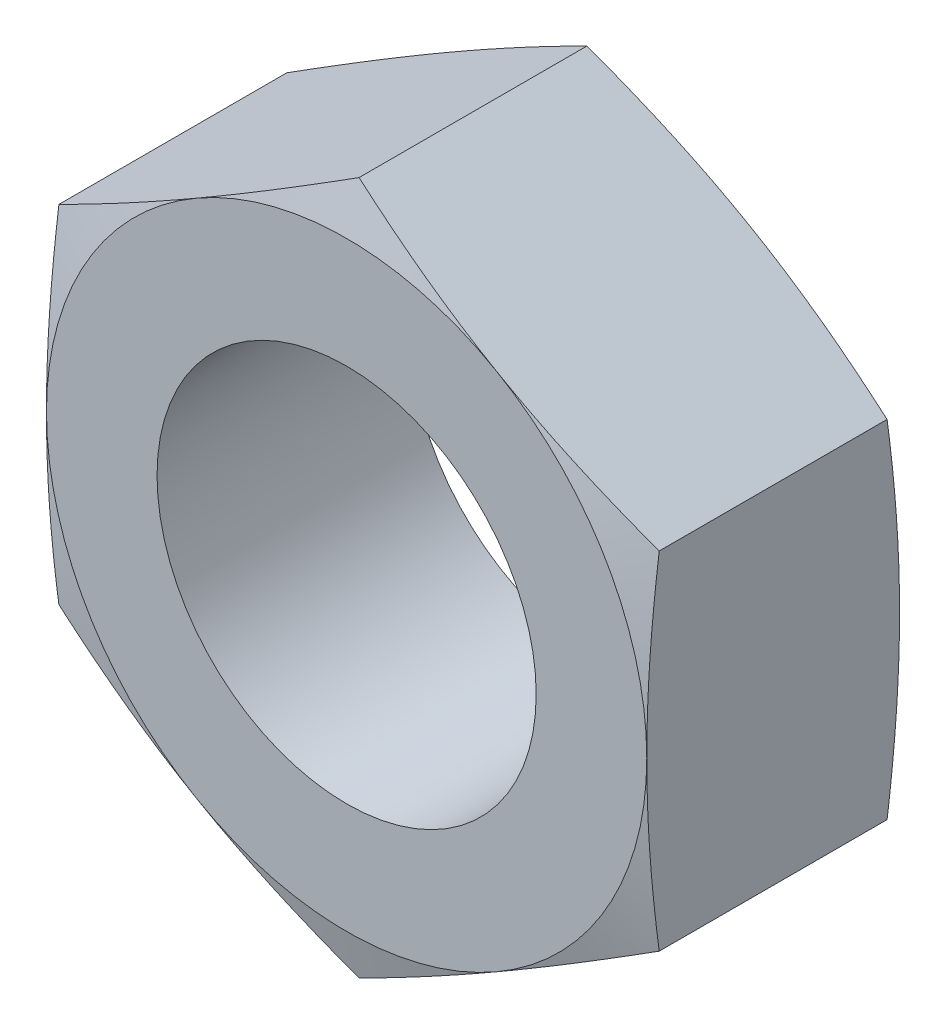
ISO-10303-21;
HEADER;
FILE_DESCRIPTION(('STEP AP214'),'2;1');
FILE_NAME('part.step','',(''),(''),'','','');
FILE_SCHEMA(('AUTOMOTIVE_DESIGN { 1 0 10303 214 1 1 1 1 }'));
ENDSEC;
DATA;
#1=APPLICATION_CONTEXT('core data for automotive mechanical design processes');
#2=APPLICATION_PROTOCOL_DEFINITION('international standard','automotive_design',2000,#1);
#3=PRODUCT_CONTEXT('',#1,'mechanical');
#4=PRODUCT('Part','Part','',(#3));
#5=PRODUCT_RELATED_PRODUCT_CATEGORY('part','',(#4));
#6=PRODUCT_DEFINITION_FORMATION('','',#4);
#7=PRODUCT_DEFINITION_CONTEXT('part definition',#1,'design');
#8=PRODUCT_DEFINITION('design','',#6,#7);
#9=PRODUCT_DEFINITION_SHAPE('','',#8);
#10=(LENGTH_UNIT() NAMED_UNIT(*) SI_UNIT(.MILLI.,.METRE.));
#11=(NAMED_UNIT(*) PLANE_ANGLE_UNIT() SI_UNIT($,.RADIAN.));
#12=(NAMED_UNIT(*) SI_UNIT($,.STERADIAN.) SOLID_ANGLE_UNIT());
#13=UNCERTAINTY_MEASURE_WITH_UNIT(LENGTH_MEASURE(1.E-05),#10,'distance_accuracy_value','');
#14=(GEOMETRIC_REPRESENTATION_CONTEXT(3) GLOBAL_UNCERTAINTY_ASSIGNED_CONTEXT((#13)) GLOBAL_UNIT_ASSIGNED_CONTEXT((#10,
#11,#12)) REPRESENTATION_CONTEXT('',''));
#15=CARTESIAN_POINT('',(0.,0.,0.));
#16=DIRECTION('',(0.,0.,1.));
#17=DIRECTION('',(1.,0.,0.));
#18=AXIS2_PLACEMENT_3D('',#15,#16,#17);
#19=CARTESIAN_POINT('',(0.,0.,8.));
#20=DIRECTION('',(0.,0.,1.));
#21=DIRECTION('',(1.,0.,0.));
#22=AXIS2_PLACEMENT_3D('',#19,#20,#21);
#23=PLANE('',#22);
#24=CARTESIAN_POINT('',(0.,0.,8.));
#25=DIRECTION('',(0.,0.,1.));
#26=DIRECTION('',(1.,0.,0.));
#27=AXIS2_PLACEMENT_3D('',#24,#25,#26);
#28=CIRCLE('',#27,6.);
#29=CARTESIAN_POINT('',(6.,0.,8.));
#30=VERTEX_POINT('',#29);
#31=EDGE_CURVE('E238',#30,#30,#28,.T.);
#32=ORIENTED_EDGE('',*,*,#31,.F.);
#33=EDGE_LOOP('',(#32));
#34=FACE_BOUND('',#33,.T.);
#35=CARTESIAN_POINT('',(0.,0.,8.));
#36=DIRECTION('',(0.,0.,1.));
#37=DIRECTION('',(1.,0.,0.));
#38=AXIS2_PLACEMENT_3D('',#35,#36,#37);
#39=CIRCLE('',#38,9.5);
#40=CARTESIAN_POINT('',(4.75,-8.22724133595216,8.));
#41=VERTEX_POINT('',#40);
#42=CARTESIAN_POINT('',(9.5,0.,8.));
#43=VERTEX_POINT('',#42);
#44=EDGE_CURVE('E150',#41,#43,#39,.T.);
#45=ORIENTED_EDGE('',*,*,#44,.T.);
#46=CARTESIAN_POINT('',(4.75,8.22724133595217,8.));
#47=VERTEX_POINT('',#46);
#48=EDGE_CURVE('E152',#43,#47,#39,.T.);
#49=ORIENTED_EDGE('',*,*,#48,.T.);
#50=CARTESIAN_POINT('',(-4.75,8.22724133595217,8.));
#51=VERTEX_POINT('',#50);
#52=EDGE_CURVE('E363',#47,#51,#39,.T.);
#53=ORIENTED_EDGE('',*,*,#52,.T.);
#54=CARTESIAN_POINT('',(-9.5,0.,8.));
#55=VERTEX_POINT('',#54);
#56=EDGE_CURVE('E36',#51,#55,#39,.T.);
#57=ORIENTED_EDGE('',*,*,#56,.T.);
#58=CARTESIAN_POINT('',(-4.75,-8.22724133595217,8.));
#59=VERTEX_POINT('',#58);
#60=EDGE_CURVE('E44',#55,#59,#39,.T.);
#61=ORIENTED_EDGE('',*,*,#60,.T.);
#62=EDGE_CURVE('E365',#59,#41,#39,.T.);
#63=ORIENTED_EDGE('',*,*,#62,.T.);
#64=EDGE_LOOP('',(#45,#49,#53,#57,#61,#63));
#65=FACE_BOUND('',#64,.T.);
#66=ADVANCED_FACE('F14',(#34,#65),#23,.T.);
#67=CARTESIAN_POINT('',(0.,0.,0.));
#68=DIRECTION('',(0.,0.,1.));
#69=DIRECTION('',(1.,0.,0.));
#70=AXIS2_PLACEMENT_3D('',#67,#68,#69);
#71=PLANE('',#70);
#72=CARTESIAN_POINT('',(0.,0.,0.));
#73=DIRECTION('',(0.,0.,1.));
#74=DIRECTION('',(1.,0.,0.));
#75=AXIS2_PLACEMENT_3D('',#72,#73,#74);
#76=CIRCLE('',#75,6.);
#77=CARTESIAN_POINT('',(6.,0.,0.));
#78=VERTEX_POINT('',#77);
#79=EDGE_CURVE('E242',#78,#78,#76,.T.);
#80=ORIENTED_EDGE('',*,*,#79,.T.);
#81=EDGE_LOOP('',(#80));
#82=FACE_BOUND('',#81,.T.);
#83=CARTESIAN_POINT('',(0.,0.,0.));
#84=DIRECTION('',(0.,0.,1.));
#85=DIRECTION('',(1.,0.,0.));
#86=AXIS2_PLACEMENT_3D('',#83,#84,#85);
#87=CIRCLE('',#86,9.5);
#88=CARTESIAN_POINT('',(9.5,0.,0.));
#89=VERTEX_POINT('',#88);
#90=CARTESIAN_POINT('',(4.75,8.22724133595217,0.));
#91=VERTEX_POINT('',#90);
#92=EDGE_CURVE('E122',#89,#91,#87,.T.);
#93=ORIENTED_EDGE('',*,*,#92,.F.);
#94=CARTESIAN_POINT('',(4.75,-8.22724133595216,0.));
#95=VERTEX_POINT('',#94);
#96=EDGE_CURVE('E151',#95,#89,#87,.T.);
#97=ORIENTED_EDGE('',*,*,#96,.F.);
#98=CARTESIAN_POINT('',(-4.75,-8.22724133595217,0.));
#99=VERTEX_POINT('',#98);
#100=EDGE_CURVE('E147',#99,#95,#87,.T.);
#101=ORIENTED_EDGE('',*,*,#100,.F.);
#102=CARTESIAN_POINT('',(-9.5,0.,0.));
#103=VERTEX_POINT('',#102);
#104=EDGE_CURVE('E146',#103,#99,#87,.T.);
#105=ORIENTED_EDGE('',*,*,#104,.F.);
#106=CARTESIAN_POINT('',(-4.75,8.22724133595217,0.));
#107=VERTEX_POINT('',#106);
#108=EDGE_CURVE('E123',#107,#103,#87,.T.);
#109=ORIENTED_EDGE('',*,*,#108,.F.);
#110=EDGE_CURVE('E111',#91,#107,#87,.T.);
#111=ORIENTED_EDGE('',*,*,#110,.F.);
#112=EDGE_LOOP('',(#93,#97,#101,#105,#109,#111));
#113=FACE_BOUND('',#112,.T.);
#114=ADVANCED_FACE('F144',(#82,#113),#71,.F.);
#115=CARTESIAN_POINT('',(0.,0.,8.));
#116=DIRECTION('',(0.,0.,-1.));
#117=DIRECTION('',(-1.,0.,0.));
#118=AXIS2_PLACEMENT_3D('',#115,#116,#117);
#119=CYLINDRICAL_SURFACE('',#118,6.);
#120=ORIENTED_EDGE('',*,*,#31,.T.);
#121=EDGE_LOOP('',(#120));
#122=FACE_BOUND('',#121,.T.);
#123=ORIENTED_EDGE('',*,*,#79,.F.);
#124=EDGE_LOOP('',(#123));
#125=FACE_BOUND('',#124,.T.);
#126=ADVANCED_FACE('F182',(#122,#125),#119,.F.);
#127=CARTESIAN_POINT('',(0.,0.,0.99089011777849));
#128=DIRECTION('',(0.,0.,1.));
#129=DIRECTION('',(1.,0.,0.));
#130=AXIS2_PLACEMENT_3D('',#127,#128,#129);
#131=CONICAL_SURFACE('',#130,13.1980522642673,1.30899693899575);
#132=CARTESIAN_POINT('',(9.5002,-5.4847120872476,0.393823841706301));
#133=CARTESIAN_POINT('',(9.10567227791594,-5.71249277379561,0.332765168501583));
#134=CARTESIAN_POINT('',(8.71042924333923,-5.9406864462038,0.277334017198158));
#135=CARTESIAN_POINT('',(7.918547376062,-6.39787965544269,0.179946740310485));
#136=CARTESIAN_POINT('',(7.52190804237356,-6.62687948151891,0.137996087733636));
#137=CARTESIAN_POINT('',(6.72963834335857,-7.084296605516,0.0700188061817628));
#138=CARTESIAN_POINT('',(6.3340133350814,-7.31271081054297,0.0439111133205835));
#139=CARTESIAN_POINT('',(5.54225880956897,-7.76983049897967,0.00890337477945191));
#140=CARTESIAN_POINT('',(5.14612940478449,-7.99853591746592,0.));
#141=CARTESIAN_POINT('',(4.35387059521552,-8.45594675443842,0.));
#142=CARTESIAN_POINT('',(3.95774119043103,-8.68465217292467,0.00890337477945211));
#143=CARTESIAN_POINT('',(3.16598666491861,-9.14177186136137,0.043911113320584));
#144=CARTESIAN_POINT('',(2.77036165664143,-9.37018606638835,0.0700188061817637));
#145=CARTESIAN_POINT('',(1.97809195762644,-9.82760319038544,0.137996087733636));
#146=CARTESIAN_POINT('',(1.581452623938,-10.0566030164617,0.179946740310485));
#147=CARTESIAN_POINT('',(0.789570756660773,-10.5137962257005,0.277334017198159));
#148=CARTESIAN_POINT('',(0.394327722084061,-10.7419898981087,0.332765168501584));
#149=CARTESIAN_POINT('',(-0.000200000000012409,-10.9697705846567,0.393823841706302));
#150=B_SPLINE_CURVE_WITH_KNOTS('',3,(#132,#133,#134,#135,#136,#137,#138,#139,#140,#141,#142,
#143,#144,#145,#146,#147,#148,#149),.UNSPECIFIED.,.F.,.F.,(4,2,2,2,2,2,2,2,4),(0.,
1.37897722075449,2.75851359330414,4.13093041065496,5.50308163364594,6.87523285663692,
8.24764967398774,9.62718604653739,11.0061632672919),.UNSPECIFIED.);
#151=CARTESIAN_POINT('',(9.5,-5.48482755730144,0.393792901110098));
#152=VERTEX_POINT('',#151);
#153=EDGE_CURVE('E153',#152,#95,#150,.T.);
#154=ORIENTED_EDGE('',*,*,#153,.T.);
#155=ORIENTED_EDGE('',*,*,#96,.T.);
#156=CARTESIAN_POINT('',(9.5,-14.5441363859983,2.10926148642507));
#157=CARTESIAN_POINT('',(9.5,-14.1127501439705,2.01251307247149));
#158=CARTESIAN_POINT('',(9.5,-13.6810950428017,1.91694209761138));
#159=CARTESIAN_POINT('',(9.5,-12.8171150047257,1.72879063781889));
#160=CARTESIAN_POINT('',(9.5,-12.3847900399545,1.63621028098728));
#161=CARTESIAN_POINT('',(9.5,-11.5189558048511,1.45459611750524));
#162=CARTESIAN_POINT('',(9.5,-11.0854457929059,1.365565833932));
#163=CARTESIAN_POINT('',(9.5,-10.217525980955,1.19200724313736));
#164=CARTESIAN_POINT('',(9.5,-9.78311618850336,1.10747889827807));
#165=CARTESIAN_POINT('',(9.5,-8.91670604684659,0.944648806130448));
#166=CARTESIAN_POINT('',(9.5,-8.48471404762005,0.866302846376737));
#167=CARTESIAN_POINT('',(9.5,-7.61954259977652,0.716410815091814));
#168=CARTESIAN_POINT('',(9.5,-7.18636314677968,0.644864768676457));
#169=CARTESIAN_POINT('',(9.5,-6.31874504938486,0.51017929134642));
#170=CARTESIAN_POINT('',(9.5,-5.88430657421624,0.447038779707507));
#171=CARTESIAN_POINT('',(9.5,-5.01404603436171,0.331017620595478));
#172=CARTESIAN_POINT('',(9.5,-4.57822396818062,0.278136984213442));
#173=CARTESIAN_POINT('',(9.5,-3.70026459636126,0.184125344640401));
#174=CARTESIAN_POINT('',(9.5,-3.25811197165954,0.143135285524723));
#175=CARTESIAN_POINT('',(9.5,-2.37268765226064,0.0757279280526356));
#176=CARTESIAN_POINT('',(9.5,-1.92941598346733,0.0493102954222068));
#177=CARTESIAN_POINT('',(9.5,-1.04239766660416,0.0125881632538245));
#178=CARTESIAN_POINT('',(9.5,-0.598651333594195,0.00227620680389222));
#179=CARTESIAN_POINT('',(9.5,0.288915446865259,-0.00159977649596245));
#180=CARTESIAN_POINT('',(9.5,0.732735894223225,0.00483617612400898));
#181=CARTESIAN_POINT('',(9.5,1.62144616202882,0.0340944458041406));
#182=CARTESIAN_POINT('',(9.5,2.06633397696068,0.0569764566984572));
#183=CARTESIAN_POINT('',(9.5,2.9550679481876,0.117817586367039));
#184=CARTESIAN_POINT('',(9.5,3.39891408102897,0.155777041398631));
#185=CARTESIAN_POINT('',(9.5,4.28556022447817,0.244847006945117));
#186=CARTESIAN_POINT('',(9.5,4.72835935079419,0.29596618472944));
#187=CARTESIAN_POINT('',(9.5,5.6125311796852,0.409217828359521));
#188=CARTESIAN_POINT('',(9.5,6.05390387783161,0.47135032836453));
#189=CARTESIAN_POINT('',(9.5,6.90909234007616,0.600672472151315));
#190=CARTESIAN_POINT('',(9.5,7.32298749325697,0.667342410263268));
#191=CARTESIAN_POINT('',(9.5,8.14967764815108,0.807216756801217));
#192=CARTESIAN_POINT('',(9.5,8.56247261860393,0.880421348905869));
#193=CARTESIAN_POINT('',(9.5,9.38712056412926,1.03216334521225));
#194=CARTESIAN_POINT('',(9.5,9.79897343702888,1.11070130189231));
#195=CARTESIAN_POINT('',(9.5,10.6218201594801,1.27211977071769));
#196=CARTESIAN_POINT('',(9.5,11.0328140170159,1.35500024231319));
#197=CARTESIAN_POINT('',(9.5,11.8541690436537,1.52433438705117));
#198=CARTESIAN_POINT('',(9.5,12.2645300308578,1.61078894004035));
#199=CARTESIAN_POINT('',(9.5,13.0846251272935,1.78662610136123));
#200=CARTESIAN_POINT('',(9.5,13.494359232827,1.87600872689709));
#201=CARTESIAN_POINT('',(9.5,14.7227058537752,2.14775309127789));
#202=CARTESIAN_POINT('',(9.5,15.5405197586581,2.33372324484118));
#203=CARTESIAN_POINT('',(9.5,17.1665111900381,2.71048836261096));
#204=CARTESIAN_POINT('',(9.5,17.9747040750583,2.90121748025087));
#205=CARTESIAN_POINT('',(9.5,19.5899656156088,3.28743634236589));
#206=CARTESIAN_POINT('',(9.5,20.397034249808,3.48292617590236));
#207=CARTESIAN_POINT('',(9.5,22.0092960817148,3.87716517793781));
#208=CARTESIAN_POINT('',(9.50000000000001,22.8144903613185,4.07590993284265));
#209=CARTESIAN_POINT('',(9.50000000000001,24.4241804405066,4.47609585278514));
#210=CARTESIAN_POINT('',(9.5,25.2286762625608,4.67753692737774));
#211=CARTESIAN_POINT('',(9.5,26.0329293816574,4.87993163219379));
#212=B_SPLINE_CURVE_WITH_KNOTS('',3,(#156,#157,#158,#159,#160,#161,#162,#163,#164,#165,#166,
#167,#168,#169,#170,#171,#172,#173,#174,#175,#176,#177,#178,#179,#180,#181,#182,#183,#184,#185,
#186,#187,#188,#189,#190,#191,#192,#193,#194,#195,#196,#197,#198,#199,#200,#201,#202,#203,#204,
#205,#206,#207,#208,#209,#210,#211),.UNSPECIFIED.,.F.,.F.,(4,2,2,2,2,2,2,2,2,2,2,2,2,2,2,2,2,2,
2,2,2,2,2,2,2,2,2,4),(0.,1.32631192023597,2.65268057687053,3.98033432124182,5.30797696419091,
6.6250503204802,7.94212854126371,9.25903725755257,10.5759473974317,11.9078831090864,
13.2397882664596,14.5710765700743,15.9023632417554,17.2385066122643,18.5746797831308,
19.9117352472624,21.2487948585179,22.5064239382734,23.7640883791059,25.0218832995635,
26.2796664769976,27.537761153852,28.7958632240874,31.3118924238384,33.803056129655,
36.294266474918,38.7823402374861,41.2703307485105),.UNSPECIFIED.);
#213=EDGE_CURVE('E186',#89,#152,#212,.F.);
#214=ORIENTED_EDGE('',*,*,#213,.T.);
#215=EDGE_LOOP('',(#154,#155,#214));
#216=FACE_BOUND('',#215,.T.);
#217=ADVANCED_FACE('F179',(#216),#131,.T.);
#218=CARTESIAN_POINT('',(-0.00019999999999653,10.9697705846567,0.393823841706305));
#219=CARTESIAN_POINT('',(0.39432772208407,10.7419898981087,0.332765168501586));
#220=CARTESIAN_POINT('',(0.789570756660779,10.5137962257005,0.27733401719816));
#221=CARTESIAN_POINT('',(1.581452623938,10.0566030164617,0.179946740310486));
#222=CARTESIAN_POINT('',(1.97809195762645,9.82760319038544,0.137996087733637));
#223=CARTESIAN_POINT('',(2.77036165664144,9.37018606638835,0.0700188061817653));
#224=CARTESIAN_POINT('',(3.16598666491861,9.14177186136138,0.043911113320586));
#225=CARTESIAN_POINT('',(3.95774119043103,8.68465217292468,0.00890337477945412));
#226=CARTESIAN_POINT('',(4.35387059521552,8.45594675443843,0.));
#227=CARTESIAN_POINT('',(5.14612940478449,7.99853591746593,0.));
#228=CARTESIAN_POINT('',(5.54225880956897,7.76983049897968,0.00890337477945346));
#229=CARTESIAN_POINT('',(6.3340133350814,7.31271081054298,0.0439111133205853));
#230=CARTESIAN_POINT('',(6.72963834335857,7.08429660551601,0.0700188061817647));
#231=CARTESIAN_POINT('',(7.52190804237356,6.62687948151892,0.137996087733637));
#232=CARTESIAN_POINT('',(7.918547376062,6.3978796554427,0.179946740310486));
#233=CARTESIAN_POINT('',(8.71042924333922,5.94068644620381,0.277334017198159));
#234=CARTESIAN_POINT('',(9.10567227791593,5.71249277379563,0.332765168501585));
#235=CARTESIAN_POINT('',(9.5002,5.48471208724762,0.393823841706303));
#236=B_SPLINE_CURVE_WITH_KNOTS('',3,(#218,#219,#220,#221,#222,#223,#224,#225,#226,#227,#228,
#229,#230,#231,#232,#233,#234,#235),.UNSPECIFIED.,.F.,.F.,(4,2,2,2,2,2,2,2,4),(0.,
1.37897722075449,2.75851359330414,4.13093041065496,5.50308163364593,6.87523285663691,
8.24764967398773,9.62718604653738,11.0061632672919),.UNSPECIFIED.);
#237=CARTESIAN_POINT('',(9.5,5.48482755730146,0.393792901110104));
#238=VERTEX_POINT('',#237);
#239=EDGE_CURVE('E162',#91,#238,#236,.T.);
#240=ORIENTED_EDGE('',*,*,#239,.T.);
#241=EDGE_CURVE('E257',#238,#89,#212,.F.);
#242=ORIENTED_EDGE('',*,*,#241,.T.);
#243=ORIENTED_EDGE('',*,*,#92,.T.);
#244=EDGE_LOOP('',(#240,#242,#243));
#245=FACE_BOUND('',#244,.T.);
#246=ADVANCED_FACE('F277',(#245),#131,.T.);
#247=CARTESIAN_POINT('',(0.,0.,8.));
#248=DIRECTION('',(0.,0.,-1.));
#249=DIRECTION('',(-1.,0.,0.));
#250=AXIS2_PLACEMENT_3D('',#247,#248,#249);
#251=CONICAL_SURFACE('',#250,9.5,1.30899693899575);
#252=CARTESIAN_POINT('',(9.5002,5.48471208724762,7.6061761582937));
#253=CARTESIAN_POINT('',(9.10567227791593,5.71249277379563,7.66723483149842));
#254=CARTESIAN_POINT('',(8.71042924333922,5.94068644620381,7.72266598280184));
#255=CARTESIAN_POINT('',(7.918547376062,6.3978796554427,7.82005325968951));
#256=CARTESIAN_POINT('',(7.52190804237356,6.62687948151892,7.86200391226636));
#257=CARTESIAN_POINT('',(6.72963834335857,7.08429660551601,7.92998119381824));
#258=CARTESIAN_POINT('',(6.3340133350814,7.31271081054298,7.95608888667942));
#259=CARTESIAN_POINT('',(5.54225880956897,7.76983049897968,7.99109662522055));
#260=CARTESIAN_POINT('',(5.14612940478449,7.99853591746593,8.));
#261=CARTESIAN_POINT('',(4.35387059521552,8.45594675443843,8.));
#262=CARTESIAN_POINT('',(3.95774119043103,8.68465217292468,7.99109662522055));
#263=CARTESIAN_POINT('',(3.16598666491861,9.14177186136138,7.95608888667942));
#264=CARTESIAN_POINT('',(2.77036165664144,9.37018606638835,7.92998119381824));
#265=CARTESIAN_POINT('',(1.97809195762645,9.82760319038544,7.86200391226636));
#266=CARTESIAN_POINT('',(1.581452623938,10.0566030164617,7.82005325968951));
#267=CARTESIAN_POINT('',(0.78957075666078,10.5137962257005,7.72266598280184));
#268=CARTESIAN_POINT('',(0.394327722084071,10.7419898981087,7.66723483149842));
#269=CARTESIAN_POINT('',(-0.000199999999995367,10.9697705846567,7.6061761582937));
#270=B_SPLINE_CURVE_WITH_KNOTS('',3,(#252,#253,#254,#255,#256,#257,#258,#259,#260,#261,#262,
#263,#264,#265,#266,#267,#268,#269),.UNSPECIFIED.,.F.,.F.,(4,2,2,2,2,2,2,2,4),(0.,
1.37897722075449,2.75851359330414,4.13093041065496,5.50308163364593,6.87523285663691,
8.24764967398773,9.62718604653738,11.0061632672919),.UNSPECIFIED.);
#271=CARTESIAN_POINT('',(9.5,5.48482755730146,7.6062070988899));
#272=VERTEX_POINT('',#271);
#273=EDGE_CURVE('E237',#272,#47,#270,.T.);
#274=ORIENTED_EDGE('',*,*,#273,.T.);
#275=ORIENTED_EDGE('',*,*,#48,.F.);
#276=CARTESIAN_POINT('',(9.5,-14.5441363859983,5.89073851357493));
#277=CARTESIAN_POINT('',(9.5,-14.1127501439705,5.98748692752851));
#278=CARTESIAN_POINT('',(9.5,-13.6810950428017,6.08305790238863));
#279=CARTESIAN_POINT('',(9.5,-12.8171150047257,6.27120936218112));
#280=CARTESIAN_POINT('',(9.5,-12.3847900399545,6.36378971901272));
#281=CARTESIAN_POINT('',(9.5,-11.5189558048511,6.54540388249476));
#282=CARTESIAN_POINT('',(9.5,-11.0854457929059,6.63443416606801));
#283=CARTESIAN_POINT('',(9.5,-10.217525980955,6.80799275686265));
#284=CARTESIAN_POINT('',(9.5,-9.78311618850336,6.89252110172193));
#285=CARTESIAN_POINT('',(9.5,-8.91670604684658,7.05535119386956));
#286=CARTESIAN_POINT('',(9.5,-8.48471404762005,7.13369715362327));
#287=CARTESIAN_POINT('',(9.5,-7.61954259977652,7.28358918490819));
#288=CARTESIAN_POINT('',(9.5,-7.18636314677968,7.35513523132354));
#289=CARTESIAN_POINT('',(9.5,-6.31874504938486,7.48982070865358));
#290=CARTESIAN_POINT('',(9.5,-5.88430657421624,7.5529612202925));
#291=CARTESIAN_POINT('',(9.5,-5.01404603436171,7.66898237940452));
#292=CARTESIAN_POINT('',(9.5,-4.57822396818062,7.72186301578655));
#293=CARTESIAN_POINT('',(9.5,-3.70026459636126,7.81587465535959));
#294=CARTESIAN_POINT('',(9.5,-3.25811197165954,7.85686471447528));
#295=CARTESIAN_POINT('',(9.5,-2.37268765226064,7.92427207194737));
#296=CARTESIAN_POINT('',(9.5,-1.92941598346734,7.95068970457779));
#297=CARTESIAN_POINT('',(9.5,-1.04239766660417,7.98741183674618));
#298=CARTESIAN_POINT('',(9.5,-0.5986513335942,7.99772379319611));
#299=CARTESIAN_POINT('',(9.5,0.288915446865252,8.00159977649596));
#300=CARTESIAN_POINT('',(9.5,0.732735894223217,7.99516382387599));
#301=CARTESIAN_POINT('',(9.5,1.62144616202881,7.96590555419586));
#302=CARTESIAN_POINT('',(9.5,2.06633397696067,7.94302354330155));
#303=CARTESIAN_POINT('',(9.5,2.95506794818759,7.88218241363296));
#304=CARTESIAN_POINT('',(9.5,3.39891408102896,7.84422295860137));
#305=CARTESIAN_POINT('',(9.5,4.28556022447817,7.75515299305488));
#306=CARTESIAN_POINT('',(9.5,4.72835935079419,7.70403381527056));
#307=CARTESIAN_POINT('',(9.5,5.61253117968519,7.59078217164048));
#308=CARTESIAN_POINT('',(9.5,6.0539038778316,7.52864967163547));
#309=CARTESIAN_POINT('',(9.5,6.90909234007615,7.39932752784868));
#310=CARTESIAN_POINT('',(9.5,7.32298749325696,7.33265758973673));
#311=CARTESIAN_POINT('',(9.5,8.14967764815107,7.19278324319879));
#312=CARTESIAN_POINT('',(9.5,8.56247261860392,7.11957865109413));
#313=CARTESIAN_POINT('',(9.5,9.38712056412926,6.96783665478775));
#314=CARTESIAN_POINT('',(9.5,9.79897343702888,6.88929869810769));
#315=CARTESIAN_POINT('',(9.5,10.6218201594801,6.72788022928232));
#316=CARTESIAN_POINT('',(9.5,11.0328140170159,6.64499975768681));
#317=CARTESIAN_POINT('',(9.5,11.8541690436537,6.47566561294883));
#318=CARTESIAN_POINT('',(9.5,12.2645300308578,6.38921105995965));
#319=CARTESIAN_POINT('',(9.5,13.0846251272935,6.21337389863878));
#320=CARTESIAN_POINT('',(9.5,13.494359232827,6.12399127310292));
#321=CARTESIAN_POINT('',(9.5,14.7227058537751,5.85224690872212));
#322=CARTESIAN_POINT('',(9.5,15.5405197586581,5.66627675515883));
#323=CARTESIAN_POINT('',(9.5,17.1665111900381,5.28951163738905));
#324=CARTESIAN_POINT('',(9.5,17.9747040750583,5.09878251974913));
#325=CARTESIAN_POINT('',(9.5,19.5899656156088,4.71256365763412));
#326=CARTESIAN_POINT('',(9.5,20.397034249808,4.51707382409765));
#327=CARTESIAN_POINT('',(9.5,22.0092960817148,4.1228348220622));
#328=CARTESIAN_POINT('',(9.50000000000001,22.8144903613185,3.92409006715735));
#329=CARTESIAN_POINT('',(9.50000000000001,24.4241804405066,3.52390414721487));
#330=CARTESIAN_POINT('',(9.5,25.2286762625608,3.32246307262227));
#331=CARTESIAN_POINT('',(9.5,26.0329293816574,3.12006836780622));
#332=B_SPLINE_CURVE_WITH_KNOTS('',3,(#276,#277,#278,#279,#280,#281,#282,#283,#284,#285,#286,
#287,#288,#289,#290,#291,#292,#293,#294,#295,#296,#297,#298,#299,#300,#301,#302,#303,#304,#305,
#306,#307,#308,#309,#310,#311,#312,#313,#314,#315,#316,#317,#318,#319,#320,#321,#322,#323,#324,
#325,#326,#327,#328,#329,#330,#331),.UNSPECIFIED.,.F.,.F.,(4,2,2,2,2,2,2,2,2,2,2,2,2,2,2,2,2,2,
2,2,2,2,2,2,2,2,2,4),(0.,1.32631192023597,2.65268057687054,3.98033432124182,5.30797696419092,
6.6250503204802,7.9421285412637,9.25903725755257,10.5759473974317,11.9078831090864,
13.2397882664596,14.5710765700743,15.9023632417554,17.2385066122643,18.5746797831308,
19.9117352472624,21.2487948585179,22.5064239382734,23.7640883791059,25.0218832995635,
26.2796664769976,27.537761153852,28.7958632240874,31.3118924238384,33.803056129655,
36.294266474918,38.7823402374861,41.2703307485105),.UNSPECIFIED.);
#333=EDGE_CURVE('E19',#43,#272,#332,.T.);
#334=ORIENTED_EDGE('',*,*,#333,.T.);
#335=EDGE_LOOP('',(#274,#275,#334));
#336=FACE_BOUND('',#335,.T.);
#337=ADVANCED_FACE('F180',(#336),#251,.T.);
#338=CARTESIAN_POINT('',(-0.000200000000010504,-10.9697705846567,7.6061761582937));
#339=CARTESIAN_POINT('',(0.394327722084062,-10.7419898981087,7.66723483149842));
#340=CARTESIAN_POINT('',(0.789570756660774,-10.5137962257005,7.72266598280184));
#341=CARTESIAN_POINT('',(1.581452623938,-10.0566030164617,7.82005325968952));
#342=CARTESIAN_POINT('',(1.97809195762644,-9.82760319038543,7.86200391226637));
#343=CARTESIAN_POINT('',(2.77036165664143,-9.37018606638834,7.92998119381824));
#344=CARTESIAN_POINT('',(3.16598666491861,-9.14177186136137,7.95608888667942));
#345=CARTESIAN_POINT('',(3.95774119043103,-8.68465217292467,7.99109662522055));
#346=CARTESIAN_POINT('',(4.35387059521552,-8.45594675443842,8.));
#347=CARTESIAN_POINT('',(5.14612940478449,-7.99853591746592,8.));
#348=CARTESIAN_POINT('',(5.54225880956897,-7.76983049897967,7.99109662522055));
#349=CARTESIAN_POINT('',(6.3340133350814,-7.31271081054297,7.95608888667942));
#350=CARTESIAN_POINT('',(6.72963834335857,-7.084296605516,7.92998119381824));
#351=CARTESIAN_POINT('',(7.52190804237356,-6.62687948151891,7.86200391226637));
#352=CARTESIAN_POINT('',(7.918547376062,-6.39787965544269,7.82005325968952));
#353=CARTESIAN_POINT('',(8.71042924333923,-5.9406864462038,7.72266598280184));
#354=CARTESIAN_POINT('',(9.10567227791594,-5.71249277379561,7.66723483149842));
#355=CARTESIAN_POINT('',(9.5002,-5.4847120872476,7.6061761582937));
#356=B_SPLINE_CURVE_WITH_KNOTS('',3,(#338,#339,#340,#341,#342,#343,#344,#345,#346,#347,#348,
#349,#350,#351,#352,#353,#354,#355),.UNSPECIFIED.,.F.,.F.,(4,2,2,2,2,2,2,2,4),(0.,
1.37897722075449,2.75851359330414,4.13093041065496,5.50308163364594,6.87523285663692,
8.24764967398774,9.62718604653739,11.0061632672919),.UNSPECIFIED.);
#357=CARTESIAN_POINT('',(9.5,-5.48482755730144,7.6062070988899));
#358=VERTEX_POINT('',#357);
#359=EDGE_CURVE('E285',#41,#358,#356,.T.);
#360=ORIENTED_EDGE('',*,*,#359,.T.);
#361=EDGE_CURVE('E9',#358,#43,#332,.T.);
#362=ORIENTED_EDGE('',*,*,#361,.T.);
#363=ORIENTED_EDGE('',*,*,#44,.F.);
#364=EDGE_LOOP('',(#360,#362,#363));
#365=FACE_BOUND('',#364,.T.);
#366=ADVANCED_FACE('F337',(#365),#251,.T.);
#367=CARTESIAN_POINT('',(0.000199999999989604,-10.9697705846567,0.393823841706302));
#368=CARTESIAN_POINT('',(-0.394327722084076,-10.7419898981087,0.332765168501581));
#369=CARTESIAN_POINT('',(-0.789570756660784,-10.5137962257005,0.277334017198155));
#370=CARTESIAN_POINT('',(-1.58145262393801,-10.0566030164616,0.17994674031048));
#371=CARTESIAN_POINT('',(-1.97809195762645,-9.82760319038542,0.137996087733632));
#372=CARTESIAN_POINT('',(-2.77036165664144,-9.37018606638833,0.0700188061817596));
#373=CARTESIAN_POINT('',(-3.16598666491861,-9.14177186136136,0.0439111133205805));
#374=CARTESIAN_POINT('',(-3.95774119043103,-8.68465217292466,0.00890337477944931));
#375=CARTESIAN_POINT('',(-4.35387059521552,-8.45594675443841,0.));
#376=CARTESIAN_POINT('',(-5.14612940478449,-7.99853591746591,0.));
#377=CARTESIAN_POINT('',(-5.54225880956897,-7.76983049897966,0.00890337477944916));
#378=CARTESIAN_POINT('',(-6.33401333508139,-7.31271081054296,0.0439111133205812));
#379=CARTESIAN_POINT('',(-6.72963834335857,-7.08429660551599,0.0700188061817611));
#380=CARTESIAN_POINT('',(-7.52190804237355,-6.6268794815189,0.137996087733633));
#381=CARTESIAN_POINT('',(-7.918547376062,-6.39787965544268,0.179946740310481));
#382=CARTESIAN_POINT('',(-8.71042924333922,-5.9406864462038,0.277334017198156));
#383=CARTESIAN_POINT('',(-9.10567227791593,-5.71249277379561,0.332765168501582));
#384=CARTESIAN_POINT('',(-9.5002,-5.48471208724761,0.393823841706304));
#385=B_SPLINE_CURVE_WITH_KNOTS('',3,(#367,#368,#369,#370,#371,#372,#373,#374,#375,#376,#377,
#378,#379,#380,#381,#382,#383,#384),.UNSPECIFIED.,.F.,.F.,(4,2,2,2,2,2,2,2,4),(0.,
1.37897722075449,2.75851359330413,4.13093041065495,5.50308163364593,6.8752328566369,
8.24764967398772,9.62718604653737,11.0061632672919),.UNSPECIFIED.);
#386=CARTESIAN_POINT('',(0.,-10.9696551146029,0.393792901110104));
#387=VERTEX_POINT('',#386);
#388=EDGE_CURVE('E142',#387,#99,#385,.T.);
#389=ORIENTED_EDGE('',*,*,#388,.T.);
#390=ORIENTED_EDGE('',*,*,#100,.T.);
#391=EDGE_CURVE('E163',#95,#387,#150,.T.);
#392=ORIENTED_EDGE('',*,*,#391,.T.);
#393=EDGE_LOOP('',(#389,#390,#392));
#394=FACE_BOUND('',#393,.T.);
#395=ADVANCED_FACE('F334',(#394),#131,.T.);
#396=CARTESIAN_POINT('',(-9.5002,-5.48471208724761,7.6061761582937));
#397=CARTESIAN_POINT('',(-9.10567227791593,-5.71249277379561,7.66723483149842));
#398=CARTESIAN_POINT('',(-8.71042924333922,-5.9406864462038,7.72266598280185));
#399=CARTESIAN_POINT('',(-7.918547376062,-6.39787965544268,7.82005325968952));
#400=CARTESIAN_POINT('',(-7.52190804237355,-6.6268794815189,7.86200391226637));
#401=CARTESIAN_POINT('',(-6.72963834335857,-7.08429660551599,7.92998119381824));
#402=CARTESIAN_POINT('',(-6.33401333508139,-7.31271081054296,7.95608888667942));
#403=CARTESIAN_POINT('',(-5.54225880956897,-7.76983049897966,7.99109662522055));
#404=CARTESIAN_POINT('',(-5.14612940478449,-7.99853591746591,8.));
#405=CARTESIAN_POINT('',(-4.35387059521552,-8.45594675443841,8.));
#406=CARTESIAN_POINT('',(-3.95774119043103,-8.68465217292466,7.99109662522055));
#407=CARTESIAN_POINT('',(-3.16598666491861,-9.14177186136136,7.95608888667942));
#408=CARTESIAN_POINT('',(-2.77036165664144,-9.37018606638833,7.92998119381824));
#409=CARTESIAN_POINT('',(-1.97809195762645,-9.82760319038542,7.86200391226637));
#410=CARTESIAN_POINT('',(-1.58145262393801,-10.0566030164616,7.82005325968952));
#411=CARTESIAN_POINT('',(-0.789570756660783,-10.5137962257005,7.72266598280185));
#412=CARTESIAN_POINT('',(-0.394327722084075,-10.7419898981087,7.66723483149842));
#413=CARTESIAN_POINT('',(0.000199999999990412,-10.9697705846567,7.6061761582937));
#414=B_SPLINE_CURVE_WITH_KNOTS('',3,(#396,#397,#398,#399,#400,#401,#402,#403,#404,#405,#406,
#407,#408,#409,#410,#411,#412,#413),.UNSPECIFIED.,.F.,.F.,(4,2,2,2,2,2,2,2,4),(0.,
1.37897722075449,2.75851359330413,4.13093041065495,5.50308163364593,6.8752328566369,
8.24764967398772,9.62718604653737,11.0061632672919),.UNSPECIFIED.);
#415=CARTESIAN_POINT('',(0.,-10.9696551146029,7.6062070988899));
#416=VERTEX_POINT('',#415);
#417=EDGE_CURVE('E290',#59,#416,#414,.T.);
#418=ORIENTED_EDGE('',*,*,#417,.T.);
#419=EDGE_CURVE('E286',#416,#41,#356,.T.);
#420=ORIENTED_EDGE('',*,*,#419,.T.);
#421=ORIENTED_EDGE('',*,*,#62,.F.);
#422=EDGE_LOOP('',(#418,#420,#421));
#423=FACE_BOUND('',#422,.T.);
#424=ADVANCED_FACE('F177',(#423),#251,.T.);
#425=CARTESIAN_POINT('',(-9.5,-14.5441363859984,2.10926148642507));
#426=CARTESIAN_POINT('',(-9.5,-14.1127501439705,2.0125130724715));
#427=CARTESIAN_POINT('',(-9.5,-13.6810950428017,1.91694209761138));
#428=CARTESIAN_POINT('',(-9.5,-12.8171150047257,1.72879063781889));
#429=CARTESIAN_POINT('',(-9.5,-12.3847900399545,1.63621028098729));
#430=CARTESIAN_POINT('',(-9.5,-11.5189558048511,1.45459611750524));
#431=CARTESIAN_POINT('',(-9.5,-11.0854457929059,1.365565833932));
#432=CARTESIAN_POINT('',(-9.5,-10.217525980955,1.19200724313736));
#433=CARTESIAN_POINT('',(-9.5,-9.78311618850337,1.10747889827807));
#434=CARTESIAN_POINT('',(-9.5,-8.91670604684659,0.944648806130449));
#435=CARTESIAN_POINT('',(-9.5,-8.48471404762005,0.866302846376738));
#436=CARTESIAN_POINT('',(-9.5,-7.61954259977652,0.716410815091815));
#437=CARTESIAN_POINT('',(-9.5,-7.18636314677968,0.644864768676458));
#438=CARTESIAN_POINT('',(-9.5,-6.31874504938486,0.51017929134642));
#439=CARTESIAN_POINT('',(-9.5,-5.88430657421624,0.447038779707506));
#440=CARTESIAN_POINT('',(-9.5,-5.01404603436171,0.331017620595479));
#441=CARTESIAN_POINT('',(-9.5,-4.57822396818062,0.278136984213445));
#442=CARTESIAN_POINT('',(-9.5,-3.70026459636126,0.184125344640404));
#443=CARTESIAN_POINT('',(-9.5,-3.25811197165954,0.143135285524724));
#444=CARTESIAN_POINT('',(-9.5,-2.37268765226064,0.0757279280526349));
#445=CARTESIAN_POINT('',(-9.5,-1.92941598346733,0.0493102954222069));
#446=CARTESIAN_POINT('',(-9.5,-1.04239766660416,0.0125881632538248));
#447=CARTESIAN_POINT('',(-9.5,-0.598651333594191,0.00227620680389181));
#448=CARTESIAN_POINT('',(-9.5,0.288915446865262,-0.00159977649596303));
#449=CARTESIAN_POINT('',(-9.5,0.732735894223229,0.0048361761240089));
#450=CARTESIAN_POINT('',(-9.5,1.62144616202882,0.0340944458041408));
#451=CARTESIAN_POINT('',(-9.5,2.06633397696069,0.0569764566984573));
#452=CARTESIAN_POINT('',(-9.5,2.95506794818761,0.117817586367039));
#453=CARTESIAN_POINT('',(-9.5,3.39891408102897,0.155777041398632));
#454=CARTESIAN_POINT('',(-9.5,4.28556022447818,0.244847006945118));
#455=CARTESIAN_POINT('',(-9.5,4.7283593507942,0.295966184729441));
#456=CARTESIAN_POINT('',(-9.5,5.61253117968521,0.409217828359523));
#457=CARTESIAN_POINT('',(-9.5,6.05390387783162,0.471350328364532));
#458=CARTESIAN_POINT('',(-9.5,6.90909234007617,0.600672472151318));
#459=CARTESIAN_POINT('',(-9.5,7.32298749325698,0.66734241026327));
#460=CARTESIAN_POINT('',(-9.5,8.14967764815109,0.807216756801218));
#461=CARTESIAN_POINT('',(-9.5,8.56247261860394,0.880421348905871));
#462=CARTESIAN_POINT('',(-9.5,9.38712056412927,1.03216334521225));
#463=CARTESIAN_POINT('',(-9.5,9.79897343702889,1.11070130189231));
#464=CARTESIAN_POINT('',(-9.5,10.6218201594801,1.27211977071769));
#465=CARTESIAN_POINT('',(-9.5,11.0328140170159,1.35500024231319));
#466=CARTESIAN_POINT('',(-9.5,11.8541690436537,1.52433438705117));
#467=CARTESIAN_POINT('',(-9.5,12.2645300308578,1.61078894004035));
#468=CARTESIAN_POINT('',(-9.5,13.0846251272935,1.78662610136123));
#469=CARTESIAN_POINT('',(-9.5,13.494359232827,1.87600872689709));
#470=CARTESIAN_POINT('',(-9.5,14.7227058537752,2.14775309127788));
#471=CARTESIAN_POINT('',(-9.5,15.5405197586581,2.33372324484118));
#472=CARTESIAN_POINT('',(-9.5,17.1665111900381,2.71048836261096));
#473=CARTESIAN_POINT('',(-9.5,17.9747040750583,2.90121748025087));
#474=CARTESIAN_POINT('',(-9.5,19.5899656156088,3.28743634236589));
#475=CARTESIAN_POINT('',(-9.5,20.397034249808,3.48292617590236));
#476=CARTESIAN_POINT('',(-9.5,22.0092960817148,3.8771651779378));
#477=CARTESIAN_POINT('',(-9.5,22.8144903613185,4.07590993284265));
#478=CARTESIAN_POINT('',(-9.5,24.4241804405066,4.47609585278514));
#479=CARTESIAN_POINT('',(-9.5,25.2286762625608,4.67753692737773));
#480=CARTESIAN_POINT('',(-9.5,26.0329293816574,4.87993163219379));
#481=B_SPLINE_CURVE_WITH_KNOTS('',3,(#425,#426,#427,#428,#429,#430,#431,#432,#433,#434,#435,
#436,#437,#438,#439,#440,#441,#442,#443,#444,#445,#446,#447,#448,#449,#450,#451,#452,#453,#454,
#455,#456,#457,#458,#459,#460,#461,#462,#463,#464,#465,#466,#467,#468,#469,#470,#471,#472,#473,
#474,#475,#476,#477,#478,#479,#480),.UNSPECIFIED.,.F.,.F.,(4,2,2,2,2,2,2,2,2,2,2,2,2,2,2,2,2,2,
2,2,2,2,2,2,2,2,2,4),(0.,1.32631192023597,2.65268057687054,3.98033432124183,5.30797696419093,
6.62505032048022,7.94212854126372,9.25903725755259,10.5759473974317,11.9078831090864,
13.2397882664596,14.5710765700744,15.9023632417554,17.2385066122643,18.5746797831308,
19.9117352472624,21.248794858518,22.5064239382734,23.764088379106,25.0218832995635,
26.2796664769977,27.5377611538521,28.7958632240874,31.3118924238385,33.803056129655,
36.294266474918,38.7823402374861,41.2703307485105),.UNSPECIFIED.);
#482=CARTESIAN_POINT('',(-9.5,-5.48482755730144,0.393792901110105));
#483=VERTEX_POINT('',#482);
#484=EDGE_CURVE('E284',#483,#103,#481,.T.);
#485=ORIENTED_EDGE('',*,*,#484,.T.);
#486=ORIENTED_EDGE('',*,*,#104,.T.);
#487=EDGE_CURVE('E135',#99,#483,#385,.T.);
#488=ORIENTED_EDGE('',*,*,#487,.T.);
#489=EDGE_LOOP('',(#485,#486,#488));
#490=FACE_BOUND('',#489,.T.);
#491=ADVANCED_FACE('F172',(#490),#131,.T.);
#492=CARTESIAN_POINT('',(-9.5,-14.5441363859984,5.89073851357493));
#493=CARTESIAN_POINT('',(-9.5,-14.1127501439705,5.98748692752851));
#494=CARTESIAN_POINT('',(-9.5,-13.6810950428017,6.08305790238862));
#495=CARTESIAN_POINT('',(-9.5,-12.8171150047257,6.27120936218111));
#496=CARTESIAN_POINT('',(-9.5,-12.3847900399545,6.36378971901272));
#497=CARTESIAN_POINT('',(-9.5,-11.5189558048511,6.54540388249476));
#498=CARTESIAN_POINT('',(-9.5,-11.0854457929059,6.634434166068));
#499=CARTESIAN_POINT('',(-9.5,-10.217525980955,6.80799275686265));
#500=CARTESIAN_POINT('',(-9.5,-9.78311618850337,6.89252110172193));
#501=CARTESIAN_POINT('',(-9.5,-8.9167060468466,7.05535119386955));
#502=CARTESIAN_POINT('',(-9.5,-8.48471404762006,7.13369715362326));
#503=CARTESIAN_POINT('',(-9.5,-7.61954259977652,7.28358918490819));
#504=CARTESIAN_POINT('',(-9.5,-7.18636314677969,7.35513523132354));
#505=CARTESIAN_POINT('',(-9.5,-6.31874504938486,7.48982070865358));
#506=CARTESIAN_POINT('',(-9.5,-5.88430657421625,7.55296122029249));
#507=CARTESIAN_POINT('',(-9.5,-5.01404603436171,7.66898237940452));
#508=CARTESIAN_POINT('',(-9.5,-4.57822396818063,7.72186301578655));
#509=CARTESIAN_POINT('',(-9.5,-3.70026459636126,7.8158746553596));
#510=CARTESIAN_POINT('',(-9.5,-3.25811197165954,7.85686471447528));
#511=CARTESIAN_POINT('',(-9.5,-2.37268765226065,7.92427207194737));
#512=CARTESIAN_POINT('',(-9.5,-1.92941598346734,7.95068970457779));
#513=CARTESIAN_POINT('',(-9.5,-1.04239766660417,7.98741183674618));
#514=CARTESIAN_POINT('',(-9.5,-0.598651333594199,7.99772379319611));
#515=CARTESIAN_POINT('',(-9.5,0.288915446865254,8.00159977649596));
#516=CARTESIAN_POINT('',(-9.5,0.73273589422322,7.99516382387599));
#517=CARTESIAN_POINT('',(-9.5,1.62144616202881,7.96590555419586));
#518=CARTESIAN_POINT('',(-9.5,2.06633397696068,7.94302354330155));
#519=CARTESIAN_POINT('',(-9.5,2.9550679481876,7.88218241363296));
#520=CARTESIAN_POINT('',(-9.5,3.39891408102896,7.84422295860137));
#521=CARTESIAN_POINT('',(-9.5,4.28556022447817,7.75515299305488));
#522=CARTESIAN_POINT('',(-9.5,4.72835935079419,7.70403381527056));
#523=CARTESIAN_POINT('',(-9.5,5.6125311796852,7.59078217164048));
#524=CARTESIAN_POINT('',(-9.5,6.05390387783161,7.52864967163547));
#525=CARTESIAN_POINT('',(-9.5,6.90909234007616,7.39932752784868));
#526=CARTESIAN_POINT('',(-9.5,7.32298749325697,7.33265758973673));
#527=CARTESIAN_POINT('',(-9.5,8.14967764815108,7.19278324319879));
#528=CARTESIAN_POINT('',(-9.5,8.56247261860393,7.11957865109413));
#529=CARTESIAN_POINT('',(-9.5,9.38712056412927,6.96783665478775));
#530=CARTESIAN_POINT('',(-9.5,9.79897343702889,6.88929869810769));
#531=CARTESIAN_POINT('',(-9.5,10.6218201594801,6.72788022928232));
#532=CARTESIAN_POINT('',(-9.5,11.0328140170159,6.64499975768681));
#533=CARTESIAN_POINT('',(-9.5,11.8541690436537,6.47566561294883));
#534=CARTESIAN_POINT('',(-9.5,12.2645300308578,6.38921105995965));
#535=CARTESIAN_POINT('',(-9.5,13.0846251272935,6.21337389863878));
#536=CARTESIAN_POINT('',(-9.5,13.494359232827,6.12399127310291));
#537=CARTESIAN_POINT('',(-9.5,14.7227058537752,5.85224690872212));
#538=CARTESIAN_POINT('',(-9.5,15.5405197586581,5.66627675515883));
#539=CARTESIAN_POINT('',(-9.5,17.1665111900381,5.28951163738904));
#540=CARTESIAN_POINT('',(-9.5,17.9747040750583,5.09878251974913));
#541=CARTESIAN_POINT('',(-9.5,19.5899656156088,4.71256365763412));
#542=CARTESIAN_POINT('',(-9.5,20.397034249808,4.51707382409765));
#543=CARTESIAN_POINT('',(-9.5,22.0092960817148,4.1228348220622));
#544=CARTESIAN_POINT('',(-9.5,22.8144903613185,3.92409006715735));
#545=CARTESIAN_POINT('',(-9.5,24.4241804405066,3.52390414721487));
#546=CARTESIAN_POINT('',(-9.5,25.2286762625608,3.32246307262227));
#547=CARTESIAN_POINT('',(-9.5,26.0329293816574,3.12006836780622));
#548=B_SPLINE_CURVE_WITH_KNOTS('',3,(#492,#493,#494,#495,#496,#497,#498,#499,#500,#501,#502,
#503,#504,#505,#506,#507,#508,#509,#510,#511,#512,#513,#514,#515,#516,#517,#518,#519,#520,#521,
#522,#523,#524,#525,#526,#527,#528,#529,#530,#531,#532,#533,#534,#535,#536,#537,#538,#539,#540,
#541,#542,#543,#544,#545,#546,#547),.UNSPECIFIED.,.F.,.F.,(4,2,2,2,2,2,2,2,2,2,2,2,2,2,2,2,2,2,
2,2,2,2,2,2,2,2,2,4),(0.,1.32631192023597,2.65268057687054,3.98033432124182,5.30797696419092,
6.62505032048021,7.94212854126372,9.25903725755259,10.5759473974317,11.9078831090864,
13.2397882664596,14.5710765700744,15.9023632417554,17.2385066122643,18.5746797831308,
19.9117352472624,21.2487948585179,22.5064239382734,23.764088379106,25.0218832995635,
26.2796664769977,27.5377611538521,28.7958632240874,31.3118924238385,33.803056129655,
36.294266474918,38.7823402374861,41.2703307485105),.UNSPECIFIED.);
#549=CARTESIAN_POINT('',(-9.5,-5.48482755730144,7.6062070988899));
#550=VERTEX_POINT('',#549);
#551=EDGE_CURVE('E225',#55,#550,#548,.F.);
#552=ORIENTED_EDGE('',*,*,#551,.T.);
#553=EDGE_CURVE('E299',#550,#59,#414,.T.);
#554=ORIENTED_EDGE('',*,*,#553,.T.);
#555=ORIENTED_EDGE('',*,*,#60,.F.);
#556=EDGE_LOOP('',(#552,#554,#555));
#557=FACE_BOUND('',#556,.T.);
#558=ADVANCED_FACE('F176',(#557),#251,.T.);
#559=CARTESIAN_POINT('',(-9.5,5.48482755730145,0.393792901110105));
#560=VERTEX_POINT('',#559);
#561=EDGE_CURVE('E131',#103,#560,#481,.T.);
#562=ORIENTED_EDGE('',*,*,#561,.T.);
#563=CARTESIAN_POINT('',(-9.5002,5.48471208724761,0.393823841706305));
#564=CARTESIAN_POINT('',(-9.10567227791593,5.71249277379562,0.332765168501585));
#565=CARTESIAN_POINT('',(-8.71042924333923,5.94068644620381,0.277334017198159));
#566=CARTESIAN_POINT('',(-7.918547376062,6.3978796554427,0.179946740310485));
#567=CARTESIAN_POINT('',(-7.52190804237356,6.62687948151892,0.137996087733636));
#568=CARTESIAN_POINT('',(-6.72963834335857,7.084296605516,0.0700188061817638));
#569=CARTESIAN_POINT('',(-6.33401333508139,7.31271081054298,0.0439111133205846));
#570=CARTESIAN_POINT('',(-5.54225880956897,7.76983049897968,0.00890337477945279));
#571=CARTESIAN_POINT('',(-5.14612940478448,7.99853591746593,0.));
#572=CARTESIAN_POINT('',(-4.35387059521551,8.45594675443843,0.));
#573=CARTESIAN_POINT('',(-3.95774119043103,8.68465217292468,0.00890337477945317));
#574=CARTESIAN_POINT('',(-3.1659866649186,9.14177186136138,0.0439111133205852));
#575=CARTESIAN_POINT('',(-2.77036165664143,9.37018606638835,0.0700188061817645));
#576=CARTESIAN_POINT('',(-1.97809195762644,9.82760319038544,0.137996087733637));
#577=CARTESIAN_POINT('',(-1.581452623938,10.0566030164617,0.179946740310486));
#578=CARTESIAN_POINT('',(-0.789570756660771,10.5137962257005,0.27733401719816));
#579=CARTESIAN_POINT('',(-0.394327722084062,10.7419898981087,0.332765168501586));
#580=CARTESIAN_POINT('',(0.000200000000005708,10.9697705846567,0.393823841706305));
#581=B_SPLINE_CURVE_WITH_KNOTS('',3,(#563,#564,#565,#566,#567,#568,#569,#570,#571,#572,#573,
#574,#575,#576,#577,#578,#579,#580),.UNSPECIFIED.,.F.,.F.,(4,2,2,2,2,2,2,2,4),(0.,
1.37897722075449,2.75851359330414,4.13093041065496,5.50308163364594,6.87523285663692,
8.24764967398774,9.62718604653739,11.0061632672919),.UNSPECIFIED.);
#582=EDGE_CURVE('E127',#560,#107,#581,.T.);
#583=ORIENTED_EDGE('',*,*,#582,.T.);
#584=ORIENTED_EDGE('',*,*,#108,.T.);
#585=EDGE_LOOP('',(#562,#583,#584));
#586=FACE_BOUND('',#585,.T.);
#587=ADVANCED_FACE('F128',(#586),#131,.T.);
#588=CARTESIAN_POINT('',(0.000200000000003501,10.9697705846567,7.6061761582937));
#589=CARTESIAN_POINT('',(-0.394327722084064,10.7419898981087,7.66723483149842));
#590=CARTESIAN_POINT('',(-0.789570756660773,10.5137962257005,7.72266598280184));
#591=CARTESIAN_POINT('',(-1.581452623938,10.0566030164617,7.82005325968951));
#592=CARTESIAN_POINT('',(-1.97809195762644,9.82760319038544,7.86200391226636));
#593=CARTESIAN_POINT('',(-2.77036165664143,9.37018606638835,7.92998119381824));
#594=CARTESIAN_POINT('',(-3.16598666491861,9.14177186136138,7.95608888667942));
#595=CARTESIAN_POINT('',(-3.95774119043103,8.68465217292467,7.99109662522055));
#596=CARTESIAN_POINT('',(-4.35387059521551,8.45594675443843,8.));
#597=CARTESIAN_POINT('',(-5.14612940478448,7.99853591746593,8.));
#598=CARTESIAN_POINT('',(-5.54225880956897,7.76983049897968,7.99109662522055));
#599=CARTESIAN_POINT('',(-6.33401333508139,7.31271081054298,7.95608888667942));
#600=CARTESIAN_POINT('',(-6.72963834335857,7.084296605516,7.92998119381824));
#601=CARTESIAN_POINT('',(-7.52190804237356,6.62687948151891,7.86200391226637));
#602=CARTESIAN_POINT('',(-7.918547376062,6.3978796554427,7.82005325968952));
#603=CARTESIAN_POINT('',(-8.71042924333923,5.94068644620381,7.72266598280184));
#604=CARTESIAN_POINT('',(-9.10567227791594,5.71249277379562,7.66723483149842));
#605=CARTESIAN_POINT('',(-9.5002,5.48471208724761,7.6061761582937));
#606=B_SPLINE_CURVE_WITH_KNOTS('',3,(#588,#589,#590,#591,#592,#593,#594,#595,#596,#597,#598,
#599,#600,#601,#602,#603,#604,#605),.UNSPECIFIED.,.F.,.F.,(4,2,2,2,2,2,2,2,4),(0.,
1.37897722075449,2.75851359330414,4.13093041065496,5.50308163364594,6.87523285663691,
8.24764967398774,9.62718604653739,11.0061632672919),.UNSPECIFIED.);
#607=CARTESIAN_POINT('',(-9.5,5.48482755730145,7.6062070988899));
#608=VERTEX_POINT('',#607);
#609=EDGE_CURVE('E216',#51,#608,#606,.T.);
#610=ORIENTED_EDGE('',*,*,#609,.T.);
#611=EDGE_CURVE('E224',#608,#55,#548,.F.);
#612=ORIENTED_EDGE('',*,*,#611,.T.);
#613=ORIENTED_EDGE('',*,*,#56,.F.);
#614=EDGE_LOOP('',(#610,#612,#613));
#615=FACE_BOUND('',#614,.T.);
#616=ADVANCED_FACE('F330',(#615),#251,.T.);
#617=CARTESIAN_POINT('',(0.,10.9696551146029,0.393792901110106));
#618=VERTEX_POINT('',#617);
#619=EDGE_CURVE('E115',#107,#618,#581,.T.);
#620=ORIENTED_EDGE('',*,*,#619,.T.);
#621=EDGE_CURVE('E117',#618,#91,#236,.T.);
#622=ORIENTED_EDGE('',*,*,#621,.T.);
#623=ORIENTED_EDGE('',*,*,#110,.T.);
#624=EDGE_LOOP('',(#620,#622,#623));
#625=FACE_BOUND('',#624,.T.);
#626=ADVANCED_FACE('F113',(#625),#131,.T.);
#627=CARTESIAN_POINT('',(0.,10.9696551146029,7.6062070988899));
#628=VERTEX_POINT('',#627);
#629=EDGE_CURVE('E231',#47,#628,#270,.T.);
#630=ORIENTED_EDGE('',*,*,#629,.T.);
#631=EDGE_CURVE('E223',#628,#51,#606,.T.);
#632=ORIENTED_EDGE('',*,*,#631,.T.);
#633=ORIENTED_EDGE('',*,*,#52,.F.);
#634=EDGE_LOOP('',(#630,#632,#633));
#635=FACE_BOUND('',#634,.T.);
#636=ADVANCED_FACE('F324',(#635),#251,.T.);
#637=CARTESIAN_POINT('',(9.5,-5.48482755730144,8.));
#638=DIRECTION('',(-1.,0.,0.));
#639=DIRECTION('',(0.,-1.,0.));
#640=AXIS2_PLACEMENT_3D('',#637,#638,#639);
#641=PLANE('',#640);
#642=ORIENTED_EDGE('',*,*,#361,.F.);
#643=DIRECTION('',(0.,0.,-1.));
#644=VECTOR('',#643,1.);
#645=CARTESIAN_POINT('',(9.5,-5.48482755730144,8.));
#646=LINE('',#645,#644);
#647=EDGE_CURVE('E247',#358,#152,#646,.T.);
#648=ORIENTED_EDGE('',*,*,#647,.T.);
#649=ORIENTED_EDGE('',*,*,#213,.F.);
#650=ORIENTED_EDGE('',*,*,#241,.F.);
#651=DIRECTION('',(0.,0.,-1.));
#652=VECTOR('',#651,1.);
#653=CARTESIAN_POINT('',(9.5,5.48482755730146,8.));
#654=LINE('',#653,#652);
#655=EDGE_CURVE('E241',#272,#238,#654,.T.);
#656=ORIENTED_EDGE('',*,*,#655,.F.);
#657=ORIENTED_EDGE('',*,*,#333,.F.);
#658=EDGE_LOOP('',(#642,#648,#649,#650,#656,#657));
#659=FACE_BOUND('',#658,.T.);
#660=ADVANCED_FACE('F274',(#659),#641,.F.);
#661=CARTESIAN_POINT('',(0.,-10.9696551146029,8.));
#662=DIRECTION('',(-0.5,0.866025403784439,0.));
#663=DIRECTION('',(-0.866025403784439,-0.5,0.));
#664=AXIS2_PLACEMENT_3D('',#661,#662,#663);
#665=PLANE('',#664);
#666=ORIENTED_EDGE('',*,*,#419,.F.);
#667=DIRECTION('',(0.,0.,-1.));
#668=VECTOR('',#667,1.);
#669=CARTESIAN_POINT('',(0.,-10.9696551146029,8.));
#670=LINE('',#669,#668);
#671=EDGE_CURVE('E250',#416,#387,#670,.T.);
#672=ORIENTED_EDGE('',*,*,#671,.T.);
#673=ORIENTED_EDGE('',*,*,#391,.F.);
#674=ORIENTED_EDGE('',*,*,#153,.F.);
#675=ORIENTED_EDGE('',*,*,#647,.F.);
#676=ORIENTED_EDGE('',*,*,#359,.F.);
#677=EDGE_LOOP('',(#666,#672,#673,#674,#675,#676));
#678=FACE_BOUND('',#677,.T.);
#679=ADVANCED_FACE('F169',(#678),#665,.F.);
#680=CARTESIAN_POINT('',(-9.5,-5.48482755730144,8.));
#681=DIRECTION('',(0.5,0.866025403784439,0.));
#682=DIRECTION('',(-0.866025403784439,0.5,0.));
#683=AXIS2_PLACEMENT_3D('',#680,#681,#682);
#684=PLANE('',#683);
#685=ORIENTED_EDGE('',*,*,#553,.F.);
#686=DIRECTION('',(0.,0.,-1.));
#687=VECTOR('',#686,1.);
#688=CARTESIAN_POINT('',(-9.5,-5.48482755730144,8.));
#689=LINE('',#688,#687);
#690=EDGE_CURVE('E253',#550,#483,#689,.T.);
#691=ORIENTED_EDGE('',*,*,#690,.T.);
#692=ORIENTED_EDGE('',*,*,#487,.F.);
#693=ORIENTED_EDGE('',*,*,#388,.F.);
#694=ORIENTED_EDGE('',*,*,#671,.F.);
#695=ORIENTED_EDGE('',*,*,#417,.F.);
#696=EDGE_LOOP('',(#685,#691,#692,#693,#694,#695));
#697=FACE_BOUND('',#696,.T.);
#698=ADVANCED_FACE('F300',(#697),#684,.F.);
#699=CARTESIAN_POINT('',(-9.5,5.48482755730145,8.));
#700=DIRECTION('',(1.,0.,0.));
#701=DIRECTION('',(0.,1.,0.));
#702=AXIS2_PLACEMENT_3D('',#699,#700,#701);
#703=PLANE('',#702);
#704=ORIENTED_EDGE('',*,*,#611,.F.);
#705=DIRECTION('',(0.,0.,-1.));
#706=VECTOR('',#705,1.);
#707=CARTESIAN_POINT('',(-9.5,5.48482755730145,8.));
#708=LINE('',#707,#706);
#709=EDGE_CURVE('E256',#608,#560,#708,.T.);
#710=ORIENTED_EDGE('',*,*,#709,.T.);
#711=ORIENTED_EDGE('',*,*,#561,.F.);
#712=ORIENTED_EDGE('',*,*,#484,.F.);
#713=ORIENTED_EDGE('',*,*,#690,.F.);
#714=ORIENTED_EDGE('',*,*,#551,.F.);
#715=EDGE_LOOP('',(#704,#710,#711,#712,#713,#714));
#716=FACE_BOUND('',#715,.T.);
#717=ADVANCED_FACE('F212',(#716),#703,.F.);
#718=CARTESIAN_POINT('',(0.,10.9696551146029,8.));
#719=DIRECTION('',(0.5,-0.866025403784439,0.));
#720=DIRECTION('',(0.866025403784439,0.5,0.));
#721=AXIS2_PLACEMENT_3D('',#718,#719,#720);
#722=PLANE('',#721);
#723=ORIENTED_EDGE('',*,*,#631,.F.);
#724=DIRECTION('',(0.,0.,-1.));
#725=VECTOR('',#724,1.);
#726=CARTESIAN_POINT('',(0.,10.9696551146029,8.));
#727=LINE('',#726,#725);
#728=EDGE_CURVE('E141',#628,#618,#727,.T.);
#729=ORIENTED_EDGE('',*,*,#728,.T.);
#730=ORIENTED_EDGE('',*,*,#619,.F.);
#731=ORIENTED_EDGE('',*,*,#582,.F.);
#732=ORIENTED_EDGE('',*,*,#709,.F.);
#733=ORIENTED_EDGE('',*,*,#609,.F.);
#734=EDGE_LOOP('',(#723,#729,#730,#731,#732,#733));
#735=FACE_BOUND('',#734,.T.);
#736=ADVANCED_FACE('F139',(#735),#722,.F.);
#737=CARTESIAN_POINT('',(9.5,5.48482755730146,8.));
#738=DIRECTION('',(-0.5,-0.866025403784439,0.));
#739=DIRECTION('',(0.866025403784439,-0.5,0.));
#740=AXIS2_PLACEMENT_3D('',#737,#738,#739);
#741=PLANE('',#740);
#742=ORIENTED_EDGE('',*,*,#273,.F.);
#743=ORIENTED_EDGE('',*,*,#655,.T.);
#744=ORIENTED_EDGE('',*,*,#239,.F.);
#745=ORIENTED_EDGE('',*,*,#621,.F.);
#746=ORIENTED_EDGE('',*,*,#728,.F.);
#747=ORIENTED_EDGE('',*,*,#629,.F.);
#748=EDGE_LOOP('',(#742,#743,#744,#745,#746,#747));
#749=FACE_BOUND('',#748,.T.);
#750=ADVANCED_FACE('F16',(#749),#741,.F.);
#751=CLOSED_SHELL('',(#66,#114,#126,#217,#246,#337,#366,#395,#424,#491,#558,#587,#616,#626,#636,
#660,#679,#698,#717,#736,#750));
#752=MANIFOLD_SOLID_BREP('B1',#751);
#753=ADVANCED_BREP_SHAPE_REPRESENTATION('',(#18,#752),#14);
#754=SHAPE_DEFINITION_REPRESENTATION(#9,#753);
ENDSEC;
END-ISO-10303-21;
